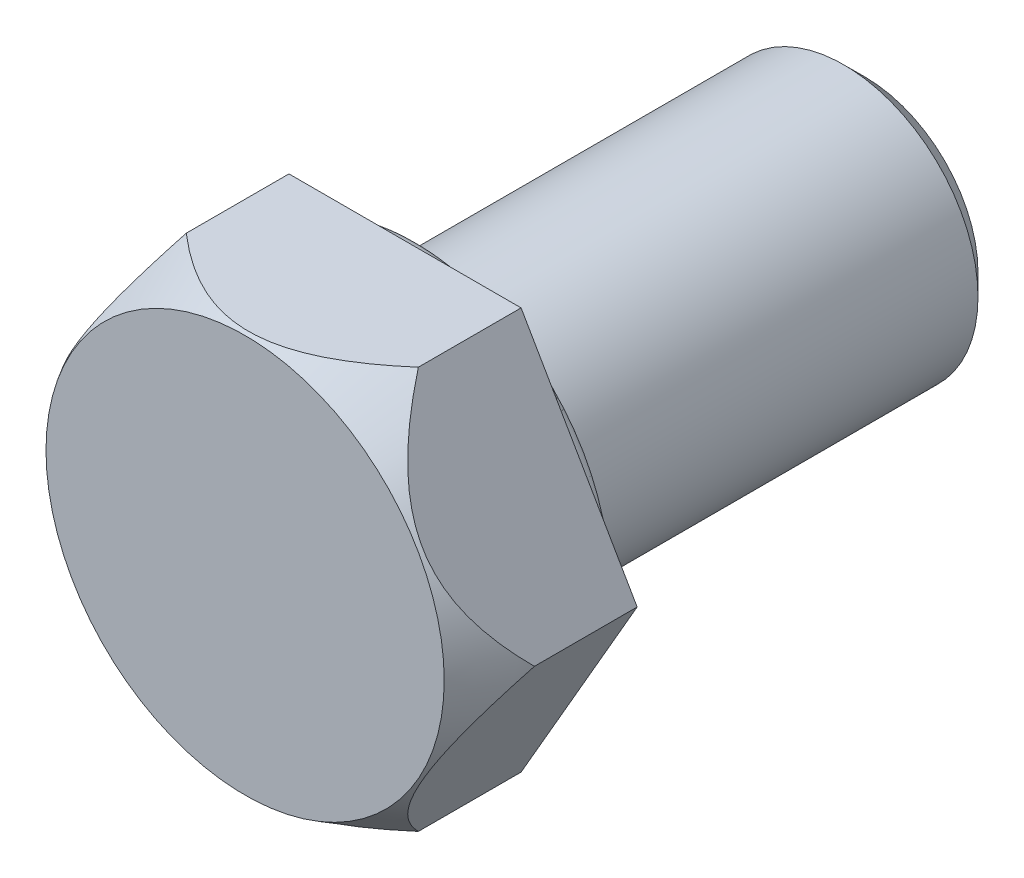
ISO-10303-21;
HEADER;
FILE_DESCRIPTION(('STEP AP214'),'2;1');
FILE_NAME('part.step','',(''),(''),'','','');
FILE_SCHEMA(('AUTOMOTIVE_DESIGN { 1 0 10303 214 1 1 1 1 }'));
ENDSEC;
DATA;
#1=APPLICATION_CONTEXT('core data for automotive mechanical design processes');
#2=APPLICATION_PROTOCOL_DEFINITION('international standard','automotive_design',2000,#1);
#3=PRODUCT_CONTEXT('',#1,'mechanical');
#4=PRODUCT('Part','Part','',(#3));
#5=PRODUCT_RELATED_PRODUCT_CATEGORY('part','',(#4));
#6=PRODUCT_DEFINITION_FORMATION('','',#4);
#7=PRODUCT_DEFINITION_CONTEXT('part definition',#1,'design');
#8=PRODUCT_DEFINITION('design','',#6,#7);
#9=PRODUCT_DEFINITION_SHAPE('','',#8);
#10=(LENGTH_UNIT() NAMED_UNIT(*) SI_UNIT(.MILLI.,.METRE.));
#11=(NAMED_UNIT(*) PLANE_ANGLE_UNIT() SI_UNIT($,.RADIAN.));
#12=(NAMED_UNIT(*) SI_UNIT($,.STERADIAN.) SOLID_ANGLE_UNIT());
#13=UNCERTAINTY_MEASURE_WITH_UNIT(LENGTH_MEASURE(1.E-05),#10,'distance_accuracy_value','');
#14=(GEOMETRIC_REPRESENTATION_CONTEXT(3) GLOBAL_UNCERTAINTY_ASSIGNED_CONTEXT((#13)) GLOBAL_UNIT_ASSIGNED_CONTEXT((#10,
#11,#12)) REPRESENTATION_CONTEXT('',''));
#15=CARTESIAN_POINT('',(0.,0.,0.));
#16=DIRECTION('',(0.,0.,1.));
#17=DIRECTION('',(1.,0.,0.));
#18=AXIS2_PLACEMENT_3D('',#15,#16,#17);
#19=CARTESIAN_POINT('',(0.,4.45714165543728,7.16));
#20=DIRECTION('',(0.,0.,1.));
#21=DIRECTION('',(1.,0.,0.));
#22=AXIS2_PLACEMENT_3D('',#19,#20,#21);
#23=PLANE('',#22);
#24=CARTESIAN_POINT('',(0.,0.,7.16000000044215));
#25=DIRECTION('',(0.,0.,-1.));
#26=DIRECTION('',(-1.,0.,0.));
#27=AXIS2_PLACEMENT_3D('',#24,#25,#26);
#28=CIRCLE('',#27,8.91428331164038);
#29=CARTESIAN_POINT('',(-8.91428331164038,0.,7.16000000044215));
#30=VERTEX_POINT('',#29);
#31=EDGE_CURVE('E91',#30,#30,#28,.T.);
#32=ORIENTED_EDGE('',*,*,#31,.F.);
#33=EDGE_LOOP('',(#32));
#34=FACE_BOUND('',#33,.T.);
#35=ADVANCED_FACE('F16',(#34),#23,.T.);
#36=CARTESIAN_POINT('',(0.,0.,4.58464003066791));
#37=DIRECTION('',(0.,0.,-1.));
#38=DIRECTION('',(-1.,0.,0.));
#39=AXIS2_PLACEMENT_3D('',#36,#37,#38);
#40=CONICAL_SURFACE('',#39,10.4011680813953,0.523598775);
#41=CARTESIAN_POINT('',(-5.1961499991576,8.99999580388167,4.59999999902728));
#42=CARTESIAN_POINT('',(-5.08742240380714,8.99999580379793,4.69415120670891));
#43=CARTESIAN_POINT('',(-4.97760953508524,8.99999580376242,4.78704613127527));
#44=CARTESIAN_POINT('',(-4.75557412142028,8.99999580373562,4.9699732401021));
#45=CARTESIAN_POINT('',(-4.64335089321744,8.99999580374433,5.06000459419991));
#46=CARTESIAN_POINT('',(-4.30163796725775,8.99999580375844,5.32610343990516));
#47=CARTESIAN_POINT('',(-4.06821526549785,8.99999580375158,5.49720261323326));
#48=CARTESIAN_POINT('',(-3.58334208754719,8.9999958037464,5.82597458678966));
#49=CARTESIAN_POINT('',(-3.3315854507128,8.9999958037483,5.98320005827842));
#50=CARTESIAN_POINT('',(-2.81444968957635,8.99999580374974,6.27258283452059));
#51=CARTESIAN_POINT('',(-2.5491029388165,8.99999580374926,6.40479648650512));
#52=CARTESIAN_POINT('',(-2.12507623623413,8.99999580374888,6.58491151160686));
#53=CARTESIAN_POINT('',(-1.97122157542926,8.99999580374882,6.64421523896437));
#54=CARTESIAN_POINT('',(-1.6593702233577,8.99999580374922,6.75100915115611));
#55=CARTESIAN_POINT('',(-1.50137249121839,8.9999958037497,6.79849633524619));
#56=CARTESIAN_POINT('',(-1.18327246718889,8.99999580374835,6.87973179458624));
#57=CARTESIAN_POINT('',(-1.02319890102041,8.99999580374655,6.91359185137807));
#58=CARTESIAN_POINT('',(-0.700724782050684,8.99999580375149,6.96683147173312));
#59=CARTESIAN_POINT('',(-0.538326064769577,8.99999580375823,6.98622187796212));
#60=CARTESIAN_POINT('',(-0.312984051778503,8.99999580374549,7.00249409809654));
#61=CARTESIAN_POINT('',(-0.250463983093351,8.99999580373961,7.00588250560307));
#62=CARTESIAN_POINT('',(-0.125299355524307,8.99999580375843,7.01040805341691));
#63=CARTESIAN_POINT('',(-0.0626547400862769,8.99999580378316,7.01154361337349));
#64=CARTESIAN_POINT('',(0.176117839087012,8.99999580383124,7.01153597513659));
#65=CARTESIAN_POINT('',(0.352315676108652,8.99999580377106,7.00254209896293));
#66=CARTESIAN_POINT('',(0.703011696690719,8.99999580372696,6.96700338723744));
#67=CARTESIAN_POINT('',(0.877508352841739,8.9999958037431,6.9404440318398));
#68=CARTESIAN_POINT('',(1.22376773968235,8.99999580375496,6.87092379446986));
#69=CARTESIAN_POINT('',(1.39551970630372,8.99999580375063,6.82790973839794));
#70=CARTESIAN_POINT('',(1.73471041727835,8.99999580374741,6.7272616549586));
#71=CARTESIAN_POINT('',(1.90214708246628,8.99999580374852,6.66962072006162));
#72=CARTESIAN_POINT('',(2.30130749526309,8.99999580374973,6.51485805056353));
#73=CARTESIAN_POINT('',(2.5305394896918,8.99999580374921,6.41131716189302));
#74=CARTESIAN_POINT('',(2.97880086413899,8.99999580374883,6.18410216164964));
#75=CARTESIAN_POINT('',(3.19782273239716,8.99999580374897,6.06041351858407));
#76=CARTESIAN_POINT('',(3.62647767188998,8.99999580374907,5.79721942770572));
#77=CARTESIAN_POINT('',(3.83609690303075,8.99999580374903,5.65769166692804));
#78=CARTESIAN_POINT('',(4.24653367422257,8.99999580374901,5.36648366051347));
#79=CARTESIAN_POINT('',(4.44735441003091,8.99999580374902,5.21480788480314));
#80=CARTESIAN_POINT('',(4.73812966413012,8.99999580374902,4.98384540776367));
#81=CARTESIAN_POINT('',(4.83105757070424,8.99999580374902,4.9082559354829));
#82=CARTESIAN_POINT('',(5.01495295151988,8.99999580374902,4.75539568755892));
#83=CARTESIAN_POINT('',(5.10592630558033,8.99999580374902,4.67813199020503));
#84=CARTESIAN_POINT('',(5.19614999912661,8.99999580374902,4.59999999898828));
#85=B_SPLINE_CURVE_WITH_KNOTS('',3,(#41,#42,#43,#44,#45,#46,#47,#48,#49,#50,#51,#52,#53,#54,#55,
#56,#57,#58,#59,#60,#61,#62,#63,#64,#65,#66,#67,#68,#69,#70,#71,#72,#73,#74,#75,#76,#77,#78,#79,
#80,#81,#82,#83,#84),.UNSPECIFIED.,.F.,.F.,(4,2,2,2,2,2,2,2,2,2,2,2,2,2,2,2,2,2,2,2,2,4),(0.,
0.431460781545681,0.86304552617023,1.73063817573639,2.62010711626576,3.50754773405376,
4.00182004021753,4.4962177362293,4.986472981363,5.47636048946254,5.66416310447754,
5.85209741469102,6.38036685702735,6.90907352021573,7.43950335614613,7.97018415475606,
8.72344819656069,9.47725795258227,10.2321431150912,10.986751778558,11.3460974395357,
11.704142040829),.UNSPECIFIED.);
#86=CARTESIAN_POINT('',(-5.19614999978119,8.99999580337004,4.59999999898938));
#87=VERTEX_POINT('',#86);
#88=CARTESIAN_POINT('',(5.19614999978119,8.99999580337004,4.59999999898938));
#89=VERTEX_POINT('',#88);
#90=EDGE_CURVE('E144',#87,#89,#85,.T.);
#91=ORIENTED_EDGE('',*,*,#90,.F.);
#92=CARTESIAN_POINT('',(-10.3922999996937,7.95863035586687E-10,4.59999999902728));
#93=CARTESIAN_POINT('',(-10.3379520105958,0.0941334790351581,4.69412382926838));
#94=CARTESIAN_POINT('',(-10.2830617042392,0.189206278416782,4.78699209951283));
#95=CARTESIAN_POINT('',(-10.1720770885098,0.38143727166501,4.96986750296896));
#96=CARTESIAN_POINT('',(-10.1159824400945,0.478596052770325,5.05987381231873));
#97=CARTESIAN_POINT('',(-9.94518175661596,0.774431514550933,5.325895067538));
#98=CARTESIAN_POINT('',(-9.82851060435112,0.976511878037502,5.49694537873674));
#99=CARTESIAN_POINT('',(-9.58608586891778,1.39640383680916,5.82573343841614));
#100=CARTESIAN_POINT('',(-9.46017551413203,1.61448696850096,5.98301309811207));
#101=CARTESIAN_POINT('',(-9.20153404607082,2.06246713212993,6.27249891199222));
#102=CARTESIAN_POINT('',(-9.06881886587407,2.29233656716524,6.40476051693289));
#103=CARTESIAN_POINT('',(-8.85847536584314,2.65666219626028,6.58345685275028));
#104=CARTESIAN_POINT('',(-8.78330919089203,2.78685383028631,6.64153434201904));
#105=CARTESIAN_POINT('',(-8.63100844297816,3.05064646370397,6.7464290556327));
#106=CARTESIAN_POINT('',(-8.55387372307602,3.18424771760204,6.79324543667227));
#107=CARTESIAN_POINT('',(-8.39855619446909,3.45326556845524,6.87382825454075));
#108=CARTESIAN_POINT('',(-8.32038650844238,3.58865943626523,6.9076950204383));
#109=CARTESIAN_POINT('',(-8.16287186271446,3.8614828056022,6.96167572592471));
#110=CARTESIAN_POINT('',(-8.0835271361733,3.99891190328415,6.98179235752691));
#111=CARTESIAN_POINT('',(-7.92350958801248,4.27607042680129,7.00758904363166));
#112=CARTESIAN_POINT('',(-7.84283126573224,4.41580938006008,7.01313434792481));
#113=CARTESIAN_POINT('',(-7.68156932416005,4.69512325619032,7.00915938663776));
#114=CARTESIAN_POINT('',(-7.60098570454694,4.83469817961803,6.99963917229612));
#115=CARTESIAN_POINT('',(-7.44040237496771,5.11283666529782,6.96590129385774));
#116=CARTESIAN_POINT('',(-7.36040454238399,5.25139697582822,6.94164823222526));
#117=CARTESIAN_POINT('',(-7.20176527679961,5.52616824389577,6.87939131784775));
#118=CARTESIAN_POINT('',(-7.12312403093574,5.66237887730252,6.84138558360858));
#119=CARTESIAN_POINT('',(-6.9451319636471,5.97067018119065,6.74016806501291));
#120=CARTESIAN_POINT('',(-6.84636581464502,6.14173816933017,6.67284580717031));
#121=CARTESIAN_POINT('',(-6.65225637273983,6.47794558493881,6.52076840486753));
#122=CARTESIAN_POINT('',(-6.55691461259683,6.64308235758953,6.43600556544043));
#123=CARTESIAN_POINT('',(-6.36939530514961,6.96787532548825,6.25178040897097));
#124=CARTESIAN_POINT('',(-6.27723242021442,7.12750612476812,6.15225894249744));
#125=CARTESIAN_POINT('',(-6.09637376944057,7.44076249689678,5.94150518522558));
#126=CARTESIAN_POINT('',(-6.00767743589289,7.59438905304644,5.83027482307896));
#127=CARTESIAN_POINT('',(-5.79297137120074,7.96627086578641,5.54440141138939));
#128=CARTESIAN_POINT('',(-5.66877591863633,8.18138369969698,5.36431041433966));
#129=CARTESIAN_POINT('',(-5.48760864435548,8.49517462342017,5.08396566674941));
#130=CARTESIAN_POINT('',(-5.42839428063,8.59773690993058,4.98937868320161));
#131=CARTESIAN_POINT('',(-5.31130346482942,8.80054415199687,4.79699309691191));
#132=CARTESIAN_POINT('',(-5.25342673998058,8.90078958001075,4.69919515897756));
#133=CARTESIAN_POINT('',(-5.19615000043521,8.99999580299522,4.59999999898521));
#134=B_SPLINE_CURVE_WITH_KNOTS('',3,(#92,#93,#94,#95,#96,#97,#98,#99,#100,#101,#102,#103,#104,
#105,#106,#107,#108,#109,#110,#111,#112,#113,#114,#115,#116,#117,#118,#119,#120,#121,#122,#123,
#124,#125,#126,#127,#128,#129,#130,#131,#132,#133),.UNSPECIFIED.,.F.,.F.,(4,2,2,2,2,2,2,2,2,2,2,
2,2,2,2,2,2,2,2,2,4),(0.,0.431335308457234,0.862793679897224,1.73010570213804,2.61982440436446,
3.50754738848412,3.99066409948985,4.47381697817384,4.95314681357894,5.43238277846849,
5.91603519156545,6.39968595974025,6.88450338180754,7.3693871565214,7.9944325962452,
8.61975440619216,9.24765372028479,9.87544977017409,10.794985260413,11.2496434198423,
11.7042080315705),.UNSPECIFIED.);
#135=CARTESIAN_POINT('',(-10.3922999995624,0.,4.59999999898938));
#136=VERTEX_POINT('',#135);
#137=EDGE_CURVE('E87',#136,#87,#134,.T.);
#138=ORIENTED_EDGE('',*,*,#137,.F.);
#139=CARTESIAN_POINT('',(-5.19615000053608,-8.9999958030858,4.59999999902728));
#140=CARTESIAN_POINT('',(-5.25049798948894,-8.90586232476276,4.69412382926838));
#141=CARTESIAN_POINT('',(-5.30538829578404,-8.81078952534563,4.78699209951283));
#142=CARTESIAN_POINT('',(-5.41637291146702,-8.6185585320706,4.96986750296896));
#143=CARTESIAN_POINT('',(-5.47246755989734,-8.521399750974,5.05987381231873));
#144=CARTESIAN_POINT('',(-5.64326824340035,-8.2255642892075,5.325895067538));
#145=CARTESIAN_POINT('',(-5.7599393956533,-8.02348392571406,5.49694537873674));
#146=CARTESIAN_POINT('',(-6.00236413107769,-7.60359196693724,5.82573343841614));
#147=CARTESIAN_POINT('',(-6.12827448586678,-7.38550883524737,5.98301309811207));
#148=CARTESIAN_POINT('',(-6.38691595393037,-6.93752867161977,6.27249891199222));
#149=CARTESIAN_POINT('',(-6.51963113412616,-6.7076592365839,6.40476051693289));
#150=CARTESIAN_POINT('',(-6.72997463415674,-6.34333360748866,6.58345685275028));
#151=CARTESIAN_POINT('',(-6.80514080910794,-6.21314197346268,6.64153434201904));
#152=CARTESIAN_POINT('',(-6.95744155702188,-5.94934934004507,6.74642905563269));
#153=CARTESIAN_POINT('',(-7.034576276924,-5.81574808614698,6.79324543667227));
#154=CARTESIAN_POINT('',(-7.1898938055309,-5.54673023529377,6.87382825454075));
#155=CARTESIAN_POINT('',(-7.26806349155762,-5.41133636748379,6.9076950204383));
#156=CARTESIAN_POINT('',(-7.42557813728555,-5.13851299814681,6.9616757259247));
#157=CARTESIAN_POINT('',(-7.50492286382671,-5.00108390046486,6.9817923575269));
#158=CARTESIAN_POINT('',(-7.66494041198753,-4.72392537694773,7.00758904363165));
#159=CARTESIAN_POINT('',(-7.74561873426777,-4.58418642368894,7.01313434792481));
#160=CARTESIAN_POINT('',(-7.90688067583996,-4.3048725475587,7.00915938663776));
#161=CARTESIAN_POINT('',(-7.98746429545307,-4.16529762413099,6.99963917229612));
#162=CARTESIAN_POINT('',(-8.14804762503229,-3.88715913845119,6.96590129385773));
#163=CARTESIAN_POINT('',(-8.22804545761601,-3.7485988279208,6.94164823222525));
#164=CARTESIAN_POINT('',(-8.38668472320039,-3.47382755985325,6.87939131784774));
#165=CARTESIAN_POINT('',(-8.46532596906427,-3.33761692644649,6.84138558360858));
#166=CARTESIAN_POINT('',(-8.6433180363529,-3.02932562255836,6.74016806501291));
#167=CARTESIAN_POINT('',(-8.74208418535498,-2.85825763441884,6.6728458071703));
#168=CARTESIAN_POINT('',(-8.93619362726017,-2.52205021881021,6.52076840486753));
#169=CARTESIAN_POINT('',(-9.03153538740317,-2.35691344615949,6.43600556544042));
#170=CARTESIAN_POINT('',(-9.2190546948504,-2.03212047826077,6.25178040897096));
#171=CARTESIAN_POINT('',(-9.31121757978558,-1.87248967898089,6.15225894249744));
#172=CARTESIAN_POINT('',(-9.49207623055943,-1.55923330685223,5.94150518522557));
#173=CARTESIAN_POINT('',(-9.58077256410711,-1.40560675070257,5.83027482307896));
#174=CARTESIAN_POINT('',(-9.79547862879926,-1.0337249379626,5.54440141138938));
#175=CARTESIAN_POINT('',(-9.91967408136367,-0.81861210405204,5.36431041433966));
#176=CARTESIAN_POINT('',(-10.1008413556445,-0.504821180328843,5.08396566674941));
#177=CARTESIAN_POINT('',(-10.16005571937,-0.402258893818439,4.98937868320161));
#178=CARTESIAN_POINT('',(-10.2771465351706,-0.199451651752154,4.79699309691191));
#179=CARTESIAN_POINT('',(-10.3350232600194,-0.0992062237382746,4.69919515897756));
#180=CARTESIAN_POINT('',(-10.3922999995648,-7.53799850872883E-10,4.59999999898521));
#181=B_SPLINE_CURVE_WITH_KNOTS('',3,(#139,#140,#141,#142,#143,#144,#145,#146,#147,#148,#149,
#150,#151,#152,#153,#154,#155,#156,#157,#158,#159,#160,#161,#162,#163,#164,#165,#166,#167,#168,
#169,#170,#171,#172,#173,#174,#175,#176,#177,#178,#179,#180),.UNSPECIFIED.,.F.,.F.,(4,2,2,2,2,2,
2,2,2,2,2,2,2,2,2,2,2,2,2,2,4),(0.,0.431335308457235,0.862793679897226,1.73010570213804,
2.61982440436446,3.50754738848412,3.99066409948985,4.47381697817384,4.95314681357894,
5.43238277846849,5.91603519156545,6.39968595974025,6.88450338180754,7.3693871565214,
7.99443259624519,8.61975440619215,9.24765372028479,9.87544977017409,10.794985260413,
11.2496434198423,11.7042080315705),.UNSPECIFIED.);
#182=CARTESIAN_POINT('',(-5.19615000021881,-8.99999580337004,4.5999999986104));
#183=VERTEX_POINT('',#182);
#184=EDGE_CURVE('E78',#183,#136,#181,.T.);
#185=ORIENTED_EDGE('',*,*,#184,.F.);
#186=CARTESIAN_POINT('',(5.1961499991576,-8.99999580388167,4.59999999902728));
#187=CARTESIAN_POINT('',(5.08742240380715,-8.99999580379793,4.69415120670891));
#188=CARTESIAN_POINT('',(4.97760953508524,-8.99999580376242,4.78704613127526));
#189=CARTESIAN_POINT('',(4.75557412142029,-8.99999580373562,4.9699732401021));
#190=CARTESIAN_POINT('',(4.64335089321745,-8.99999580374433,5.0600045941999));
#191=CARTESIAN_POINT('',(4.30163796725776,-8.99999580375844,5.32610343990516));
#192=CARTESIAN_POINT('',(4.06821526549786,-8.99999580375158,5.49720261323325));
#193=CARTESIAN_POINT('',(3.58334208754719,-8.9999958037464,5.82597458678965));
#194=CARTESIAN_POINT('',(3.3315854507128,-8.9999958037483,5.98320005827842));
#195=CARTESIAN_POINT('',(2.81444968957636,-8.99999580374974,6.27258283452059));
#196=CARTESIAN_POINT('',(2.54910293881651,-8.99999580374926,6.40479648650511));
#197=CARTESIAN_POINT('',(2.12507623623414,-8.99999580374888,6.58491151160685));
#198=CARTESIAN_POINT('',(1.97122157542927,-8.99999580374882,6.64421523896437));
#199=CARTESIAN_POINT('',(1.65937022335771,-8.99999580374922,6.75100915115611));
#200=CARTESIAN_POINT('',(1.50137249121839,-8.9999958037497,6.79849633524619));
#201=CARTESIAN_POINT('',(1.1832724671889,-8.99999580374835,6.87973179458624));
#202=CARTESIAN_POINT('',(1.02319890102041,-8.99999580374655,6.91359185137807));
#203=CARTESIAN_POINT('',(0.700724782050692,-8.99999580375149,6.96683147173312));
#204=CARTESIAN_POINT('',(0.538326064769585,-8.99999580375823,6.98622187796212));
#205=CARTESIAN_POINT('',(0.312984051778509,-8.99999580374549,7.00249409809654));
#206=CARTESIAN_POINT('',(0.250463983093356,-8.99999580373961,7.00588250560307));
#207=CARTESIAN_POINT('',(0.12529935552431,-8.99999580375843,7.01040805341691));
#208=CARTESIAN_POINT('',(0.0626547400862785,-8.99999580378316,7.01154361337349));
#209=CARTESIAN_POINT('',(-0.176117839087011,-8.99999580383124,7.01153597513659));
#210=CARTESIAN_POINT('',(-0.352315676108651,-8.99999580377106,7.00254209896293));
#211=CARTESIAN_POINT('',(-0.703011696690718,-8.99999580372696,6.96700338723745));
#212=CARTESIAN_POINT('',(-0.877508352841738,-8.9999958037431,6.9404440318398));
#213=CARTESIAN_POINT('',(-1.22376773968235,-8.99999580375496,6.87092379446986));
#214=CARTESIAN_POINT('',(-1.39551970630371,-8.99999580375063,6.82790973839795));
#215=CARTESIAN_POINT('',(-1.73471041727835,-8.99999580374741,6.7272616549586));
#216=CARTESIAN_POINT('',(-1.90214708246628,-8.99999580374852,6.66962072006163));
#217=CARTESIAN_POINT('',(-2.30130749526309,-8.99999580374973,6.51485805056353));
#218=CARTESIAN_POINT('',(-2.53053948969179,-8.99999580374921,6.41131716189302));
#219=CARTESIAN_POINT('',(-2.97880086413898,-8.99999580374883,6.18410216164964));
#220=CARTESIAN_POINT('',(-3.19782273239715,-8.99999580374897,6.06041351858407));
#221=CARTESIAN_POINT('',(-3.62647767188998,-8.99999580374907,5.79721942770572));
#222=CARTESIAN_POINT('',(-3.83609690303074,-8.99999580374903,5.65769166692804));
#223=CARTESIAN_POINT('',(-4.24653367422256,-8.99999580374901,5.36648366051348));
#224=CARTESIAN_POINT('',(-4.44735441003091,-8.99999580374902,5.21480788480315));
#225=CARTESIAN_POINT('',(-4.73812966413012,-8.99999580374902,4.98384540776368));
#226=CARTESIAN_POINT('',(-4.83105757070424,-8.99999580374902,4.9082559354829));
#227=CARTESIAN_POINT('',(-5.01495295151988,-8.99999580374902,4.75539568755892));
#228=CARTESIAN_POINT('',(-5.10592630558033,-8.99999580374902,4.67813199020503));
#229=CARTESIAN_POINT('',(-5.19614999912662,-8.99999580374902,4.59999999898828));
#230=B_SPLINE_CURVE_WITH_KNOTS('',3,(#186,#187,#188,#189,#190,#191,#192,#193,#194,#195,#196,
#197,#198,#199,#200,#201,#202,#203,#204,#205,#206,#207,#208,#209,#210,#211,#212,#213,#214,#215,
#216,#217,#218,#219,#220,#221,#222,#223,#224,#225,#226,#227,#228,#229),.UNSPECIFIED.,.F.,.F.,(4,
2,2,2,2,2,2,2,2,2,2,2,2,2,2,2,2,2,2,2,2,4),(0.,0.431460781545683,0.863045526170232,
1.73063817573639,2.62010711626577,3.50754773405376,4.00182004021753,4.4962177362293,
4.986472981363,5.47636048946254,5.66416310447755,5.85209741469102,6.38036685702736,
6.90907352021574,7.43950335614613,7.97018415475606,8.72344819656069,9.47725795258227,
10.2321431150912,10.986751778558,11.3460974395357,11.704142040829),.UNSPECIFIED.);
#231=CARTESIAN_POINT('',(5.1961499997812,-8.99999580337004,4.59999999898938));
#232=VERTEX_POINT('',#231);
#233=EDGE_CURVE('E84',#232,#183,#230,.T.);
#234=ORIENTED_EDGE('',*,*,#233,.F.);
#235=CARTESIAN_POINT('',(10.3922999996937,-7.95866196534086E-10,4.59999999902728));
#236=CARTESIAN_POINT('',(10.3379520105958,-0.0941334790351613,4.69412382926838));
#237=CARTESIAN_POINT('',(10.2830617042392,-0.189206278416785,4.78699209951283));
#238=CARTESIAN_POINT('',(10.1720770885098,-0.381437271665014,4.96986750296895));
#239=CARTESIAN_POINT('',(10.1159824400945,-0.478596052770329,5.05987381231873));
#240=CARTESIAN_POINT('',(9.94518175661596,-0.774431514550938,5.325895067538));
#241=CARTESIAN_POINT('',(9.82851060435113,-0.976511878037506,5.49694537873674));
#242=CARTESIAN_POINT('',(9.58608586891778,-1.39640383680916,5.82573343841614));
#243=CARTESIAN_POINT('',(9.46017551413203,-1.61448696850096,5.98301309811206));
#244=CARTESIAN_POINT('',(9.20153404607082,-2.06246713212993,6.27249891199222));
#245=CARTESIAN_POINT('',(9.06881886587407,-2.29233656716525,6.40476051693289));
#246=CARTESIAN_POINT('',(8.85847536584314,-2.65666219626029,6.58345685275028));
#247=CARTESIAN_POINT('',(8.78330919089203,-2.78685383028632,6.64153434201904));
#248=CARTESIAN_POINT('',(8.63100844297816,-3.05064646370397,6.74642905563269));
#249=CARTESIAN_POINT('',(8.55387372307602,-3.18424771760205,6.79324543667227));
#250=CARTESIAN_POINT('',(8.39855619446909,-3.45326556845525,6.87382825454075));
#251=CARTESIAN_POINT('',(8.32038650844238,-3.58865943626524,6.90769502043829));
#252=CARTESIAN_POINT('',(8.16287186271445,-3.86148280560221,6.9616757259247));
#253=CARTESIAN_POINT('',(8.08352713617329,-3.99891190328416,6.9817923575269));
#254=CARTESIAN_POINT('',(7.92350958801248,-4.2760704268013,7.00758904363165));
#255=CARTESIAN_POINT('',(7.84283126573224,-4.41580938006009,7.01313434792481));
#256=CARTESIAN_POINT('',(7.68156932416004,-4.69512325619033,7.00915938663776));
#257=CARTESIAN_POINT('',(7.60098570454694,-4.83469817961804,6.99963917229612));
#258=CARTESIAN_POINT('',(7.44040237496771,-5.11283666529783,6.96590129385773));
#259=CARTESIAN_POINT('',(7.36040454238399,-5.25139697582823,6.94164823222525));
#260=CARTESIAN_POINT('',(7.20176527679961,-5.52616824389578,6.87939131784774));
#261=CARTESIAN_POINT('',(7.12312403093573,-5.66237887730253,6.84138558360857));
#262=CARTESIAN_POINT('',(6.9451319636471,-5.97067018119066,6.74016806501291));
#263=CARTESIAN_POINT('',(6.84636581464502,-6.14173816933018,6.6728458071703));
#264=CARTESIAN_POINT('',(6.65225637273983,-6.47794558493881,6.52076840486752));
#265=CARTESIAN_POINT('',(6.55691461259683,-6.64308235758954,6.43600556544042));
#266=CARTESIAN_POINT('',(6.3693953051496,-6.96787532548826,6.25178040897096));
#267=CARTESIAN_POINT('',(6.27723242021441,-7.12750612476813,6.15225894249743));
#268=CARTESIAN_POINT('',(6.09637376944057,-7.44076249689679,5.94150518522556));
#269=CARTESIAN_POINT('',(6.00767743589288,-7.59438905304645,5.83027482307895));
#270=CARTESIAN_POINT('',(5.79297137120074,-7.96627086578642,5.54440141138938));
#271=CARTESIAN_POINT('',(5.66877591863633,-8.18138369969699,5.36431041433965));
#272=CARTESIAN_POINT('',(5.48760864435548,-8.49517462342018,5.08396566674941));
#273=CARTESIAN_POINT('',(5.42839428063,-8.59773690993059,4.98937868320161));
#274=CARTESIAN_POINT('',(5.31130346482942,-8.80054415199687,4.7969930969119));
#275=CARTESIAN_POINT('',(5.25342673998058,-8.90078958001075,4.69919515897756));
#276=CARTESIAN_POINT('',(5.19615000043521,-8.99999580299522,4.59999999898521));
#277=B_SPLINE_CURVE_WITH_KNOTS('',3,(#235,#236,#237,#238,#239,#240,#241,#242,#243,#244,#245,
#246,#247,#248,#249,#250,#251,#252,#253,#254,#255,#256,#257,#258,#259,#260,#261,#262,#263,#264,
#265,#266,#267,#268,#269,#270,#271,#272,#273,#274,#275,#276),.UNSPECIFIED.,.F.,.F.,(4,2,2,2,2,2,
2,2,2,2,2,2,2,2,2,2,2,2,2,2,4),(0.,0.431335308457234,0.862793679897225,1.73010570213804,
2.61982440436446,3.50754738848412,3.99066409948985,4.47381697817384,4.95314681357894,
5.4323827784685,5.91603519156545,6.39968595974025,6.88450338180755,7.36938715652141,
7.9944325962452,8.61975440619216,9.2476537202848,9.8754497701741,10.794985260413,
11.2496434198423,11.7042080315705),.UNSPECIFIED.);
#278=CARTESIAN_POINT('',(10.3922999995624,0.,4.59999999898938));
#279=VERTEX_POINT('',#278);
#280=EDGE_CURVE('E106',#279,#232,#277,.T.);
#281=ORIENTED_EDGE('',*,*,#280,.F.);
#282=CARTESIAN_POINT('',(5.19615000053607,8.9999958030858,4.59999999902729));
#283=CARTESIAN_POINT('',(5.25049798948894,8.90586232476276,4.69412382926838));
#284=CARTESIAN_POINT('',(5.30538829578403,8.81078952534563,4.78699209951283));
#285=CARTESIAN_POINT('',(5.41637291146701,8.6185585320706,4.96986750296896));
#286=CARTESIAN_POINT('',(5.47246755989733,8.52139975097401,5.05987381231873));
#287=CARTESIAN_POINT('',(5.64326824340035,8.2255642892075,5.32589506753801));
#288=CARTESIAN_POINT('',(5.75993939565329,8.02348392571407,5.49694537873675));
#289=CARTESIAN_POINT('',(6.00236413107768,7.60359196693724,5.82573343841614));
#290=CARTESIAN_POINT('',(6.12827448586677,7.38550883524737,5.98301309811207));
#291=CARTESIAN_POINT('',(6.38691595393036,6.93752867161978,6.27249891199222));
#292=CARTESIAN_POINT('',(6.51963113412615,6.70765923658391,6.40476051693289));
#293=CARTESIAN_POINT('',(6.72997463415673,6.34333360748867,6.58345685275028));
#294=CARTESIAN_POINT('',(6.80514080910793,6.21314197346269,6.64153434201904));
#295=CARTESIAN_POINT('',(6.95744155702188,5.94934934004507,6.7464290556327));
#296=CARTESIAN_POINT('',(7.03457627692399,5.81574808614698,6.79324543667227));
#297=CARTESIAN_POINT('',(7.1898938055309,5.54673023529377,6.87382825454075));
#298=CARTESIAN_POINT('',(7.26806349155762,5.41133636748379,6.9076950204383));
#299=CARTESIAN_POINT('',(7.42557813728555,5.13851299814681,6.9616757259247));
#300=CARTESIAN_POINT('',(7.5049228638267,5.00108390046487,6.98179235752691));
#301=CARTESIAN_POINT('',(7.66494041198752,4.72392537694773,7.00758904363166));
#302=CARTESIAN_POINT('',(7.74561873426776,4.58418642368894,7.01313434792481));
#303=CARTESIAN_POINT('',(7.90688067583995,4.3048725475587,7.00915938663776));
#304=CARTESIAN_POINT('',(7.98746429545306,4.16529762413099,6.99963917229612));
#305=CARTESIAN_POINT('',(8.14804762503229,3.88715913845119,6.96590129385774));
#306=CARTESIAN_POINT('',(8.22804545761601,3.7485988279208,6.94164823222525));
#307=CARTESIAN_POINT('',(8.38668472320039,3.47382755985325,6.87939131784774));
#308=CARTESIAN_POINT('',(8.46532596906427,3.33761692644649,6.84138558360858));
#309=CARTESIAN_POINT('',(8.6433180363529,3.02932562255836,6.74016806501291));
#310=CARTESIAN_POINT('',(8.74208418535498,2.85825763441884,6.6728458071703));
#311=CARTESIAN_POINT('',(8.93619362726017,2.52205021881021,6.52076840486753));
#312=CARTESIAN_POINT('',(9.03153538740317,2.35691344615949,6.43600556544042));
#313=CARTESIAN_POINT('',(9.2190546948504,2.03212047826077,6.25178040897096));
#314=CARTESIAN_POINT('',(9.31121757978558,1.87248967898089,6.15225894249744));
#315=CARTESIAN_POINT('',(9.49207623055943,1.55923330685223,5.94150518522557));
#316=CARTESIAN_POINT('',(9.58077256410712,1.40560675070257,5.83027482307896));
#317=CARTESIAN_POINT('',(9.79547862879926,1.0337249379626,5.54440141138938));
#318=CARTESIAN_POINT('',(9.91967408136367,0.818612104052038,5.36431041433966));
#319=CARTESIAN_POINT('',(10.1008413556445,0.504821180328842,5.08396566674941));
#320=CARTESIAN_POINT('',(10.16005571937,0.402258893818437,4.98937868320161));
#321=CARTESIAN_POINT('',(10.2771465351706,0.199451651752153,4.7969930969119));
#322=CARTESIAN_POINT('',(10.3350232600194,0.0992062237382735,4.69919515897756));
#323=CARTESIAN_POINT('',(10.3922999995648,7.53799569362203E-10,4.59999999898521));
#324=B_SPLINE_CURVE_WITH_KNOTS('',3,(#282,#283,#284,#285,#286,#287,#288,#289,#290,#291,#292,
#293,#294,#295,#296,#297,#298,#299,#300,#301,#302,#303,#304,#305,#306,#307,#308,#309,#310,#311,
#312,#313,#314,#315,#316,#317,#318,#319,#320,#321,#322,#323),.UNSPECIFIED.,.F.,.F.,(4,2,2,2,2,2,
2,2,2,2,2,2,2,2,2,2,2,2,2,2,4),(0.,0.431335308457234,0.862793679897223,1.73010570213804,
2.61982440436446,3.50754738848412,3.99066409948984,4.47381697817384,4.95314681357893,
5.43238277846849,5.91603519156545,6.39968595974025,6.88450338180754,7.3693871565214,
7.9944325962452,8.61975440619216,9.2476537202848,9.8754497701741,10.794985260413,
11.2496434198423,11.7042080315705),.UNSPECIFIED.);
#325=EDGE_CURVE('E164',#89,#279,#324,.T.);
#326=ORIENTED_EDGE('',*,*,#325,.F.);
#327=EDGE_LOOP('',(#91,#138,#185,#234,#281,#326));
#328=FACE_BOUND('',#327,.T.);
#329=ORIENTED_EDGE('',*,*,#31,.T.);
#330=EDGE_LOOP('',(#329));
#331=FACE_BOUND('',#330,.T.);
#332=ADVANCED_FACE('F80',(#328,#331),#40,.T.);
#333=CARTESIAN_POINT('',(-10.3923,0.,7.16));
#334=DIRECTION('',(-0.866025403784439,-0.5,0.));
#335=DIRECTION('',(0.5,-0.866025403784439,0.));
#336=AXIS2_PLACEMENT_3D('',#333,#334,#335);
#337=PLANE('',#336);
#338=ORIENTED_EDGE('',*,*,#184,.T.);
#339=DIRECTION('',(0.,0.,1.));
#340=VECTOR('',#339,1.);
#341=CARTESIAN_POINT('',(-10.3923,0.,7.16));
#342=LINE('',#341,#340);
#343=CARTESIAN_POINT('',(-10.3923,0.,0.));
#344=VERTEX_POINT('',#343);
#345=EDGE_CURVE('E90',#344,#136,#342,.T.);
#346=ORIENTED_EDGE('',*,*,#345,.F.);
#347=DIRECTION('',(-0.5,0.866025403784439,0.));
#348=VECTOR('',#347,1.);
#349=CARTESIAN_POINT('',(-5.19615,-8.99999580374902,0.));
#350=LINE('',#349,#348);
#351=CARTESIAN_POINT('',(-5.19615,-8.99999580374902,0.));
#352=VERTEX_POINT('',#351);
#353=EDGE_CURVE('E97',#352,#344,#350,.T.);
#354=ORIENTED_EDGE('',*,*,#353,.F.);
#355=DIRECTION('',(0.,0.,-1.));
#356=VECTOR('',#355,1.);
#357=CARTESIAN_POINT('',(-5.19615,-8.99999580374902,7.16));
#358=LINE('',#357,#356);
#359=EDGE_CURVE('E94',#183,#352,#358,.T.);
#360=ORIENTED_EDGE('',*,*,#359,.F.);
#361=EDGE_LOOP('',(#338,#346,#354,#360));
#362=FACE_BOUND('',#361,.T.);
#363=ADVANCED_FACE('F95',(#362),#337,.T.);
#364=CARTESIAN_POINT('',(-5.19615,8.99999580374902,7.16));
#365=DIRECTION('',(-0.866025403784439,0.5,0.));
#366=DIRECTION('',(-0.5,-0.866025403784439,0.));
#367=AXIS2_PLACEMENT_3D('',#364,#365,#366);
#368=PLANE('',#367);
#369=ORIENTED_EDGE('',*,*,#137,.T.);
#370=DIRECTION('',(0.,0.,1.));
#371=VECTOR('',#370,1.);
#372=CARTESIAN_POINT('',(-5.19615,8.99999580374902,7.16));
#373=LINE('',#372,#371);
#374=CARTESIAN_POINT('',(-5.19615,8.99999580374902,0.));
#375=VERTEX_POINT('',#374);
#376=EDGE_CURVE('E143',#375,#87,#373,.T.);
#377=ORIENTED_EDGE('',*,*,#376,.F.);
#378=DIRECTION('',(0.5,0.866025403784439,0.));
#379=VECTOR('',#378,1.);
#380=CARTESIAN_POINT('',(-10.3923,0.,0.));
#381=LINE('',#380,#379);
#382=EDGE_CURVE('E217',#344,#375,#381,.T.);
#383=ORIENTED_EDGE('',*,*,#382,.F.);
#384=ORIENTED_EDGE('',*,*,#345,.T.);
#385=EDGE_LOOP('',(#369,#377,#383,#384));
#386=FACE_BOUND('',#385,.T.);
#387=ADVANCED_FACE('F149',(#386),#368,.T.);
#388=CARTESIAN_POINT('',(5.19615,8.99999580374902,7.16));
#389=DIRECTION('',(0.,1.,0.));
#390=DIRECTION('',(0.,0.,1.));
#391=AXIS2_PLACEMENT_3D('',#388,#389,#390);
#392=PLANE('',#391);
#393=ORIENTED_EDGE('',*,*,#90,.T.);
#394=DIRECTION('',(0.,0.,1.));
#395=VECTOR('',#394,1.);
#396=CARTESIAN_POINT('',(5.19614999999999,8.99999580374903,7.16));
#397=LINE('',#396,#395);
#398=CARTESIAN_POINT('',(5.19615,8.99999580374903,0.));
#399=VERTEX_POINT('',#398);
#400=EDGE_CURVE('E169',#399,#89,#397,.T.);
#401=ORIENTED_EDGE('',*,*,#400,.F.);
#402=DIRECTION('',(-1.,0.,0.));
#403=VECTOR('',#402,1.);
#404=CARTESIAN_POINT('',(0.,8.99999580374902,0.));
#405=LINE('',#404,#403);
#406=EDGE_CURVE('E232',#375,#399,#405,.F.);
#407=ORIENTED_EDGE('',*,*,#406,.F.);
#408=ORIENTED_EDGE('',*,*,#376,.T.);
#409=EDGE_LOOP('',(#393,#401,#407,#408));
#410=FACE_BOUND('',#409,.T.);
#411=ADVANCED_FACE('F152',(#410),#392,.T.);
#412=CARTESIAN_POINT('',(10.3923,0.,7.16));
#413=DIRECTION('',(0.866025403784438,0.5,0.));
#414=DIRECTION('',(-0.5,0.866025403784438,0.));
#415=AXIS2_PLACEMENT_3D('',#412,#413,#414);
#416=PLANE('',#415);
#417=ORIENTED_EDGE('',*,*,#325,.T.);
#418=DIRECTION('',(0.,0.,1.));
#419=VECTOR('',#418,1.);
#420=CARTESIAN_POINT('',(10.3923,0.,7.16));
#421=LINE('',#420,#419);
#422=CARTESIAN_POINT('',(10.3923,0.,0.));
#423=VERTEX_POINT('',#422);
#424=EDGE_CURVE('E168',#423,#279,#421,.T.);
#425=ORIENTED_EDGE('',*,*,#424,.F.);
#426=DIRECTION('',(0.5,-0.866025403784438,0.));
#427=VECTOR('',#426,1.);
#428=CARTESIAN_POINT('',(5.19615,8.99999580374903,0.));
#429=LINE('',#428,#427);
#430=EDGE_CURVE('E227',#399,#423,#429,.T.);
#431=ORIENTED_EDGE('',*,*,#430,.F.);
#432=ORIENTED_EDGE('',*,*,#400,.T.);
#433=EDGE_LOOP('',(#417,#425,#431,#432));
#434=FACE_BOUND('',#433,.T.);
#435=ADVANCED_FACE('F157',(#434),#416,.T.);
#436=CARTESIAN_POINT('',(5.19615,-8.99999580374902,7.16));
#437=DIRECTION('',(0.866025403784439,-0.5,0.));
#438=DIRECTION('',(0.5,0.866025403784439,0.));
#439=AXIS2_PLACEMENT_3D('',#436,#437,#438);
#440=PLANE('',#439);
#441=ORIENTED_EDGE('',*,*,#280,.T.);
#442=DIRECTION('',(0.,0.,-1.));
#443=VECTOR('',#442,1.);
#444=CARTESIAN_POINT('',(5.19615000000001,-8.99999580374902,7.16));
#445=LINE('',#444,#443);
#446=CARTESIAN_POINT('',(5.19615000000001,-8.99999580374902,0.));
#447=VERTEX_POINT('',#446);
#448=EDGE_CURVE('E104',#447,#232,#445,.F.);
#449=ORIENTED_EDGE('',*,*,#448,.F.);
#450=DIRECTION('',(-0.5,-0.866025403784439,0.));
#451=VECTOR('',#450,1.);
#452=CARTESIAN_POINT('',(10.3923,0.,0.));
#453=LINE('',#452,#451);
#454=EDGE_CURVE('E222',#423,#447,#453,.T.);
#455=ORIENTED_EDGE('',*,*,#454,.F.);
#456=ORIENTED_EDGE('',*,*,#424,.T.);
#457=EDGE_LOOP('',(#441,#449,#455,#456));
#458=FACE_BOUND('',#457,.T.);
#459=ADVANCED_FACE('F161',(#458),#440,.T.);
#460=CARTESIAN_POINT('',(-5.19615,-8.99999580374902,7.16));
#461=DIRECTION('',(0.,-1.,0.));
#462=DIRECTION('',(0.,0.,-1.));
#463=AXIS2_PLACEMENT_3D('',#460,#461,#462);
#464=PLANE('',#463);
#465=ORIENTED_EDGE('',*,*,#233,.T.);
#466=ORIENTED_EDGE('',*,*,#359,.T.);
#467=DIRECTION('',(-1.,0.,0.));
#468=VECTOR('',#467,1.);
#469=CARTESIAN_POINT('',(0.,-8.99999580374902,0.));
#470=LINE('',#469,#468);
#471=EDGE_CURVE('E220',#447,#352,#470,.T.);
#472=ORIENTED_EDGE('',*,*,#471,.F.);
#473=ORIENTED_EDGE('',*,*,#448,.T.);
#474=EDGE_LOOP('',(#465,#466,#472,#473));
#475=FACE_BOUND('',#474,.T.);
#476=ADVANCED_FACE('F103',(#475),#464,.T.);
#477=CARTESIAN_POINT('',(0.,9.64615,0.));
#478=DIRECTION('',(0.,0.,-1.));
#479=DIRECTION('',(-1.,0.,0.));
#480=AXIS2_PLACEMENT_3D('',#477,#478,#479);
#481=PLANE('',#480);
#482=CARTESIAN_POINT('',(0.,0.,0.));
#483=DIRECTION('',(0.,0.,-1.));
#484=DIRECTION('',(-1.,0.,0.));
#485=AXIS2_PLACEMENT_3D('',#482,#483,#484);
#486=CIRCLE('',#485,8.9);
#487=CARTESIAN_POINT('',(-8.9,0.,0.));
#488=VERTEX_POINT('',#487);
#489=EDGE_CURVE('E115',#488,#488,#486,.T.);
#490=ORIENTED_EDGE('',*,*,#489,.F.);
#491=EDGE_LOOP('',(#490));
#492=FACE_BOUND('',#491,.T.);
#493=ORIENTED_EDGE('',*,*,#454,.T.);
#494=ORIENTED_EDGE('',*,*,#471,.T.);
#495=ORIENTED_EDGE('',*,*,#353,.T.);
#496=ORIENTED_EDGE('',*,*,#382,.T.);
#497=ORIENTED_EDGE('',*,*,#406,.T.);
#498=ORIENTED_EDGE('',*,*,#430,.T.);
#499=EDGE_LOOP('',(#493,#494,#495,#496,#497,#498));
#500=FACE_BOUND('',#499,.T.);
#501=ADVANCED_FACE('F197',(#492,#500),#481,.T.);
#502=CARTESIAN_POINT('',(0.,0.,0.));
#503=DIRECTION('',(0.,0.,-1.));
#504=DIRECTION('',(-1.,0.,0.));
#505=AXIS2_PLACEMENT_3D('',#502,#503,#504);
#506=TOROIDAL_SURFACE('',#505,8.3,0.6);
#507=ORIENTED_EDGE('',*,*,#489,.T.);
#508=EDGE_LOOP('',(#507));
#509=FACE_BOUND('',#508,.T.);
#510=CARTESIAN_POINT('',(0.,0.,-0.600000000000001));
#511=DIRECTION('',(0.,0.,1.));
#512=DIRECTION('',(1.,0.,0.));
#513=AXIS2_PLACEMENT_3D('',#510,#511,#512);
#514=CIRCLE('',#513,8.3);
#515=CARTESIAN_POINT('',(0.,8.3,-0.6));
#516=VERTEX_POINT('',#515);
#517=CARTESIAN_POINT('',(8.3,0.,-0.6));
#518=VERTEX_POINT('',#517);
#519=EDGE_CURVE('E252',#516,#518,#514,.F.);
#520=ORIENTED_EDGE('',*,*,#519,.F.);
#521=CARTESIAN_POINT('',(0.,0.,-0.600000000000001));
#522=DIRECTION('',(0.,0.,1.));
#523=DIRECTION('',(0.,1.,0.));
#524=AXIS2_PLACEMENT_3D('',#521,#522,#523);
#525=CIRCLE('',#524,8.3);
#526=CARTESIAN_POINT('',(-8.3,0.,-0.600000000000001));
#527=VERTEX_POINT('',#526);
#528=EDGE_CURVE('E37',#527,#516,#525,.F.);
#529=ORIENTED_EDGE('',*,*,#528,.F.);
#530=CARTESIAN_POINT('',(0.,0.,-0.600000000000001));
#531=DIRECTION('',(0.,0.,1.));
#532=DIRECTION('',(-1.,0.,0.));
#533=AXIS2_PLACEMENT_3D('',#530,#531,#532);
#534=CIRCLE('',#533,8.3);
#535=EDGE_CURVE('E249',#518,#527,#534,.F.);
#536=ORIENTED_EDGE('',*,*,#535,.F.);
#537=EDGE_LOOP('',(#520,#529,#536));
#538=FACE_BOUND('',#537,.T.);
#539=ADVANCED_FACE('F192',(#509,#538),#506,.T.);
#540=CARTESIAN_POINT('',(0.,7.45,-0.6));
#541=DIRECTION('',(0.,0.,-1.));
#542=DIRECTION('',(-1.,0.,0.));
#543=AXIS2_PLACEMENT_3D('',#540,#541,#542);
#544=PLANE('',#543);
#545=CARTESIAN_POINT('',(0.,0.,-0.599999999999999));
#546=DIRECTION('',(0.,0.,-1.));
#547=DIRECTION('',(0.,1.,0.));
#548=AXIS2_PLACEMENT_3D('',#545,#546,#547);
#549=CIRCLE('',#548,6.6);
#550=CARTESIAN_POINT('',(0.,6.6,-0.599999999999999));
#551=VERTEX_POINT('',#550);
#552=EDGE_CURVE('E245',#551,#551,#549,.T.);
#553=ORIENTED_EDGE('',*,*,#552,.F.);
#554=EDGE_LOOP('',(#553));
#555=FACE_BOUND('',#554,.T.);
#556=ORIENTED_EDGE('',*,*,#535,.T.);
#557=ORIENTED_EDGE('',*,*,#528,.T.);
#558=ORIENTED_EDGE('',*,*,#519,.T.);
#559=EDGE_LOOP('',(#556,#557,#558));
#560=FACE_BOUND('',#559,.T.);
#561=ADVANCED_FACE('F196',(#555,#560),#544,.T.);
#562=CARTESIAN_POINT('',(0.,2.52640625,-20.6));
#563=DIRECTION('',(0.,0.,-1.));
#564=DIRECTION('',(-1.,0.,0.));
#565=AXIS2_PLACEMENT_3D('',#562,#563,#564);
#566=PLANE('',#565);
#567=CARTESIAN_POINT('',(0.,0.,-20.6000000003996));
#568=DIRECTION('',(0.,0.,1.));
#569=DIRECTION('',(1.,0.,0.));
#570=AXIS2_PLACEMENT_3D('',#567,#568,#569);
#571=CIRCLE('',#570,5.05281250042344);
#572=CARTESIAN_POINT('',(5.05281250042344,0.,-20.6000000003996));
#573=VERTEX_POINT('',#572);
#574=EDGE_CURVE('E243',#573,#573,#571,.T.);
#575=ORIENTED_EDGE('',*,*,#574,.F.);
#576=EDGE_LOOP('',(#575));
#577=FACE_BOUND('',#576,.T.);
#578=ADVANCED_FACE('F281',(#577),#566,.T.);
#579=CARTESIAN_POINT('',(0.,0.,-1.2));
#580=DIRECTION('',(0.,0.,-1.));
#581=DIRECTION('',(0.,1.,0.));
#582=AXIS2_PLACEMENT_3D('',#579,#580,#581);
#583=TOROIDAL_SURFACE('',#582,6.6,0.6);
#584=ORIENTED_EDGE('',*,*,#552,.T.);
#585=EDGE_LOOP('',(#584));
#586=FACE_BOUND('',#585,.T.);
#587=CARTESIAN_POINT('',(0.,0.,-1.2));
#588=DIRECTION('',(0.,0.,-1.));
#589=DIRECTION('',(-1.,0.,0.));
#590=AXIS2_PLACEMENT_3D('',#587,#588,#589);
#591=CIRCLE('',#590,6.);
#592=CARTESIAN_POINT('',(-6.,0.,-1.2));
#593=VERTEX_POINT('',#592);
#594=EDGE_CURVE('E28',#593,#593,#591,.T.);
#595=ORIENTED_EDGE('',*,*,#594,.F.);
#596=EDGE_LOOP('',(#595));
#597=FACE_BOUND('',#596,.T.);
#598=ADVANCED_FACE('F18',(#586,#597),#583,.F.);
#599=CARTESIAN_POINT('',(0.,0.,-19.6528124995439));
#600=DIRECTION('',(0.,0.,1.));
#601=DIRECTION('',(1.,0.,0.));
#602=AXIS2_PLACEMENT_3D('',#599,#600,#601);
#603=CONICAL_SURFACE('',#602,5.99999999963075,0.785398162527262);
#604=ORIENTED_EDGE('',*,*,#574,.T.);
#605=EDGE_LOOP('',(#604));
#606=FACE_BOUND('',#605,.T.);
#607=CARTESIAN_POINT('',(0.,0.,-19.6528125));
#608=DIRECTION('',(0.,0.,-1.));
#609=DIRECTION('',(-1.,0.,0.));
#610=AXIS2_PLACEMENT_3D('',#607,#608,#609);
#611=CIRCLE('',#610,6.);
#612=CARTESIAN_POINT('',(-6.,0.,-19.6528125));
#613=VERTEX_POINT('',#612);
#614=EDGE_CURVE('E10',#613,#613,#611,.F.);
#615=ORIENTED_EDGE('',*,*,#614,.F.);
#616=EDGE_LOOP('',(#615));
#617=FACE_BOUND('',#616,.T.);
#618=ADVANCED_FACE('F273',(#606,#617),#603,.T.);
#619=CARTESIAN_POINT('',(0.,0.,-10.42640625));
#620=DIRECTION('',(0.,0.,-1.));
#621=DIRECTION('',(-1.,0.,0.));
#622=AXIS2_PLACEMENT_3D('',#619,#620,#621);
#623=CYLINDRICAL_SURFACE('',#622,6.);
#624=ORIENTED_EDGE('',*,*,#594,.T.);
#625=EDGE_LOOP('',(#624));
#626=FACE_BOUND('',#625,.T.);
#627=ORIENTED_EDGE('',*,*,#614,.T.);
#628=EDGE_LOOP('',(#627));
#629=FACE_BOUND('',#628,.T.);
#630=ADVANCED_FACE('F271',(#626,#629),#623,.T.);
#631=CLOSED_SHELL('',(#35,#332,#363,#387,#411,#435,#459,#476,#501,#539,#561,#578,#598,#618,#630));
#632=MANIFOLD_SOLID_BREP('B1',#631);
#633=ADVANCED_BREP_SHAPE_REPRESENTATION('',(#18,#632),#14);
#634=SHAPE_DEFINITION_REPRESENTATION(#9,#633);
ENDSEC;
END-ISO-10303-21;
